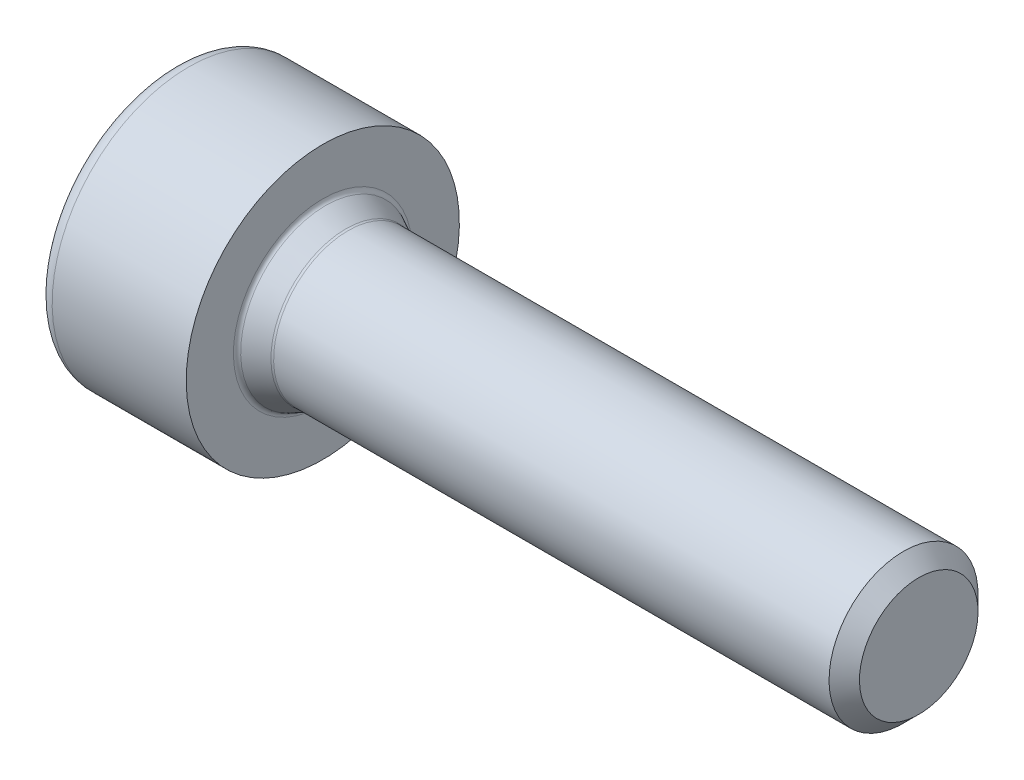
ISO-10303-21;
HEADER;
FILE_DESCRIPTION(('STEP AP214'),'2;1');
FILE_NAME('part.step','',(''),(''),'','','');
FILE_SCHEMA(('AUTOMOTIVE_DESIGN { 1 0 10303 214 1 1 1 1 }'));
ENDSEC;
DATA;
#1=APPLICATION_CONTEXT('core data for automotive mechanical design processes');
#2=APPLICATION_PROTOCOL_DEFINITION('international standard','automotive_design',2000,#1);
#3=PRODUCT_CONTEXT('',#1,'mechanical');
#4=PRODUCT('Part','Part','',(#3));
#5=PRODUCT_RELATED_PRODUCT_CATEGORY('part','',(#4));
#6=PRODUCT_DEFINITION_FORMATION('','',#4);
#7=PRODUCT_DEFINITION_CONTEXT('part definition',#1,'design');
#8=PRODUCT_DEFINITION('design','',#6,#7);
#9=PRODUCT_DEFINITION_SHAPE('','',#8);
#10=(LENGTH_UNIT() NAMED_UNIT(*) SI_UNIT(.MILLI.,.METRE.));
#11=(NAMED_UNIT(*) PLANE_ANGLE_UNIT() SI_UNIT($,.RADIAN.));
#12=(NAMED_UNIT(*) SI_UNIT($,.STERADIAN.) SOLID_ANGLE_UNIT());
#13=UNCERTAINTY_MEASURE_WITH_UNIT(LENGTH_MEASURE(1.E-05),#10,'distance_accuracy_value','');
#14=(GEOMETRIC_REPRESENTATION_CONTEXT(3) GLOBAL_UNCERTAINTY_ASSIGNED_CONTEXT((#13)) GLOBAL_UNIT_ASSIGNED_CONTEXT((#10,
#11,#12)) REPRESENTATION_CONTEXT('',''));
#15=CARTESIAN_POINT('',(0.,0.,0.));
#16=DIRECTION('',(0.,0.,1.));
#17=DIRECTION('',(1.,0.,0.));
#18=AXIS2_PLACEMENT_3D('',#15,#16,#17);
#19=CARTESIAN_POINT('',(-500.428312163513,0.,0.));
#20=DIRECTION('',(-1.,0.,0.));
#21=DIRECTION('',(0.,-1.,0.));
#22=AXIS2_PLACEMENT_3D('',#19,#20,#21);
#23=CONICAL_SURFACE('',#22,866.025403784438,1.0471975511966);
#24=CARTESIAN_POINT('',(-0.428312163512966,0.,0.));
#25=VERTEX_POINT('',#24);
#26=VERTEX_LOOP('',#25);
#27=FACE_BOUND('',#26,.T.);
#28=CARTESIAN_POINT('',(-1.15,0.,0.));
#29=DIRECTION('',(1.,0.,0.));
#30=DIRECTION('',(0.,1.,0.));
#31=AXIS2_PLACEMENT_3D('',#28,#29,#30);
#32=CIRCLE('',#31,1.25);
#33=CARTESIAN_POINT('',(-1.15,1.08253175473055,-0.625));
#34=VERTEX_POINT('',#33);
#35=CARTESIAN_POINT('',(-1.15,1.08253175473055,0.625));
#36=VERTEX_POINT('',#35);
#37=EDGE_CURVE('E125',#34,#36,#32,.T.);
#38=ORIENTED_EDGE('',*,*,#37,.F.);
#39=CARTESIAN_POINT('',(-1.15,0.,0.));
#40=DIRECTION('',(1.,0.,0.));
#41=DIRECTION('',(0.,1.,0.));
#42=AXIS2_PLACEMENT_3D('',#39,#40,#41);
#43=CIRCLE('',#42,1.25);
#44=CARTESIAN_POINT('',(-1.15,0.,-1.25));
#45=VERTEX_POINT('',#44);
#46=EDGE_CURVE('E120',#45,#34,#43,.T.);
#47=ORIENTED_EDGE('',*,*,#46,.F.);
#48=CARTESIAN_POINT('',(-1.15,0.,0.));
#49=DIRECTION('',(1.,0.,0.));
#50=DIRECTION('',(0.,1.,0.));
#51=AXIS2_PLACEMENT_3D('',#48,#49,#50);
#52=CIRCLE('',#51,1.25);
#53=CARTESIAN_POINT('',(-1.15,-1.08253175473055,-0.625));
#54=VERTEX_POINT('',#53);
#55=EDGE_CURVE('E122',#54,#45,#52,.T.);
#56=ORIENTED_EDGE('',*,*,#55,.F.);
#57=CARTESIAN_POINT('',(-1.15,0.,0.));
#58=DIRECTION('',(1.,0.,0.));
#59=DIRECTION('',(0.,1.,0.));
#60=AXIS2_PLACEMENT_3D('',#57,#58,#59);
#61=CIRCLE('',#60,1.25);
#62=CARTESIAN_POINT('',(-1.15,-1.08253175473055,0.625));
#63=VERTEX_POINT('',#62);
#64=EDGE_CURVE('E37',#63,#54,#61,.T.);
#65=ORIENTED_EDGE('',*,*,#64,.F.);
#66=CARTESIAN_POINT('',(-1.15,0.,0.));
#67=DIRECTION('',(1.,0.,0.));
#68=DIRECTION('',(0.,1.,0.));
#69=AXIS2_PLACEMENT_3D('',#66,#67,#68);
#70=CIRCLE('',#69,1.25);
#71=CARTESIAN_POINT('',(-1.15,0.,1.25));
#72=VERTEX_POINT('',#71);
#73=EDGE_CURVE('E10',#72,#63,#70,.T.);
#74=ORIENTED_EDGE('',*,*,#73,.F.);
#75=CARTESIAN_POINT('',(-1.15,0.,0.));
#76=DIRECTION('',(1.,0.,0.));
#77=DIRECTION('',(0.,1.,0.));
#78=AXIS2_PLACEMENT_3D('',#75,#76,#77);
#79=CIRCLE('',#78,1.25);
#80=EDGE_CURVE('E29',#36,#72,#79,.T.);
#81=ORIENTED_EDGE('',*,*,#80,.F.);
#82=EDGE_LOOP('',(#38,#47,#56,#65,#74,#81));
#83=FACE_BOUND('',#82,.T.);
#84=ADVANCED_FACE('F16',(#27,#83),#23,.F.);
#85=CARTESIAN_POINT('',(-3.75,-1.44337567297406,0.));
#86=DIRECTION('',(0.,-0.866025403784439,-0.5));
#87=DIRECTION('',(0.,0.5,-0.866025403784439));
#88=AXIS2_PLACEMENT_3D('',#85,#86,#87);
#89=PLANE('',#88);
#90=DIRECTION('',(0.,0.5,-0.866025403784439));
#91=VECTOR('',#90,1.);
#92=CARTESIAN_POINT('',(-1.15,-1.44337567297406,0.));
#93=LINE('',#92,#91);
#94=CARTESIAN_POINT('',(-1.15,-0.721687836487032,-1.25));
#95=VERTEX_POINT('',#94);
#96=EDGE_CURVE('E137',#54,#95,#93,.T.);
#97=ORIENTED_EDGE('',*,*,#96,.T.);
#98=DIRECTION('',(1.,0.,0.));
#99=VECTOR('',#98,1.);
#100=CARTESIAN_POINT('',(-3.75,-0.721687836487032,-1.25));
#101=LINE('',#100,#99);
#102=CARTESIAN_POINT('',(-2.99423353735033,-0.721687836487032,-1.25));
#103=VERTEX_POINT('',#102);
#104=EDGE_CURVE('E146',#103,#95,#101,.T.);
#105=ORIENTED_EDGE('',*,*,#104,.F.);
#106=CARTESIAN_POINT('',(-2.99423353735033,-1.44337567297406,0.));
#107=CARTESIAN_POINT('',(-2.97957371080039,-1.42871173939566,-0.0253962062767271));
#108=CARTESIAN_POINT('',(-2.96543639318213,-1.41390821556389,-0.0510256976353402));
#109=CARTESIAN_POINT('',(-2.93891149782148,-1.38455135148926,-0.101852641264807));
#110=CARTESIAN_POINT('',(-2.92647940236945,-1.37000802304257,-0.127032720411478));
#111=CARTESIAN_POINT('',(-2.9033584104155,-1.34111080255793,-0.177081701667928));
#112=CARTESIAN_POINT('',(-2.89262714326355,-1.32676522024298,-0.201935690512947));
#113=CARTESIAN_POINT('',(-2.87291009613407,-1.29818727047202,-0.25146253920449));
#114=CARTESIAN_POINT('',(-2.86388702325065,-1.28396122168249,-0.276124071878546));
#115=CARTESIAN_POINT('',(-2.85116247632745,-1.26178056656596,-0.314526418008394));
#116=CARTESIAN_POINT('',(-2.84690628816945,-1.25391439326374,-0.328136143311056));
#117=CARTESIAN_POINT('',(-2.83896351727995,-1.23824608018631,-0.355229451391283));
#118=CARTESIAN_POINT('',(-2.83526845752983,-1.23044513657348,-0.368711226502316));
#119=CARTESIAN_POINT('',(-2.82844925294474,-1.21489851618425,-0.395584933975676));
#120=CARTESIAN_POINT('',(-2.82531779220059,-1.20715361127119,-0.408975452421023));
#121=CARTESIAN_POINT('',(-2.81962387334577,-1.19170446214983,-0.435700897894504));
#122=CARTESIAN_POINT('',(-2.81705562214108,-1.18400068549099,-0.449034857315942));
#123=CARTESIAN_POINT('',(-2.81248669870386,-1.16861644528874,-0.47568127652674));
#124=CARTESIAN_POINT('',(-2.81048203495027,-1.16093621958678,-0.488993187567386));
#125=CARTESIAN_POINT('',(-2.80703820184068,-1.14557791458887,-0.51562856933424));
#126=CARTESIAN_POINT('',(-2.80559707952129,-1.13789992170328,-0.528951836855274));
#127=CARTESIAN_POINT('',(-2.80327877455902,-1.12252202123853,-0.55564234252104));
#128=CARTESIAN_POINT('',(-2.80240183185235,-1.1148221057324,-0.569009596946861));
#129=CARTESIAN_POINT('',(-2.80120761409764,-1.09937057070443,-0.595817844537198));
#130=CARTESIAN_POINT('',(-2.80089282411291,-1.09161887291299,-0.609258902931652));
#131=CARTESIAN_POINT('',(-2.80082875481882,-1.07615046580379,-0.636054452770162));
#132=CARTESIAN_POINT('',(-2.80107607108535,-1.06843382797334,-0.649408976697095));
#133=CARTESIAN_POINT('',(-2.80214246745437,-1.05303545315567,-0.676066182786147));
#134=CARTESIAN_POINT('',(-2.80295996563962,-1.04535367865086,-0.689368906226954));
#135=CARTESIAN_POINT('',(-2.8051623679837,-1.03000750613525,-0.715960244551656));
#136=CARTESIAN_POINT('',(-2.8065480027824,-1.02234314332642,-0.729248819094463));
#137=CARTESIAN_POINT('',(-2.80988487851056,-1.00701331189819,-0.755848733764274));
#138=CARTESIAN_POINT('',(-2.81183907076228,-0.999348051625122,-0.76915982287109));
#139=CARTESIAN_POINT('',(-2.81631079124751,-0.983994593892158,-0.795839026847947));
#140=CARTESIAN_POINT('',(-2.81883330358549,-0.976306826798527,-0.809206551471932));
#141=CARTESIAN_POINT('',(-2.82443948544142,-0.960883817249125,-0.836030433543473));
#142=CARTESIAN_POINT('',(-2.82752990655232,-0.953149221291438,-0.849485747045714));
#143=CARTESIAN_POINT('',(-2.83427116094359,-0.937606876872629,-0.876514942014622));
#144=CARTESIAN_POINT('',(-2.8379302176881,-0.929799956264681,-0.890087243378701));
#145=CARTESIAN_POINT('',(-2.84580378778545,-0.914080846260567,-0.91737563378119));
#146=CARTESIAN_POINT('',(-2.85002758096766,-0.906169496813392,-0.931089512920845));
#147=CARTESIAN_POINT('',(-2.86275065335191,-0.883668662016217,-0.970039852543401));
#148=CARTESIAN_POINT('',(-2.87182341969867,-0.86913963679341,-0.995125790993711));
#149=CARTESIAN_POINT('',(-2.89167439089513,-0.839994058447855,-1.04544920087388));
#150=CARTESIAN_POINT('',(-2.90248795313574,-0.825383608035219,-1.07067614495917));
#151=CARTESIAN_POINT('',(-2.92580460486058,-0.796003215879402,-1.12142938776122));
#152=CARTESIAN_POINT('',(-2.93834898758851,-0.781241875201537,-1.14694156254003));
#153=CARTESIAN_POINT('',(-2.96512860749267,-0.751491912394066,-1.19839367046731));
#154=CARTESIAN_POINT('',(-2.97940799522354,-0.736513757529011,-1.22431675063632));
#155=CARTESIAN_POINT('',(-2.9942335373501,-0.721687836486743,-1.2499999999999));
#156=B_SPLINE_CURVE_WITH_KNOTS('',3,(#106,#107,#108,#109,#110,#111,#112,#113,#114,#115,#116,
#117,#118,#119,#120,#121,#122,#123,#124,#125,#126,#127,#128,#129,#130,#131,#132,#133,#134,#135,
#136,#137,#138,#139,#140,#141,#142,#143,#144,#145,#146,#147,#148,#149,#150,#151,#152,#153,#154,
#155),.UNSPECIFIED.,.F.,.F.,(4,2,2,2,2,2,2,2,2,2,2,2,2,2,2,2,2,2,2,2,2,2,2,2,4),(0.,
0.0983661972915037,0.193211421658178,0.285089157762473,0.374642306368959,0.423491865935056,
0.471508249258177,0.518847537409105,0.565674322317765,0.612160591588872,0.658484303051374,
0.70482770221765,0.751375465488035,0.797642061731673,0.843780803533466,0.889979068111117,
0.936421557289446,0.98328839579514,1.03075343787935,1.07898286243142,1.12813410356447,
1.21921525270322,1.31245749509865,1.40852753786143,1.50800018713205),.UNSPECIFIED.);
#157=CARTESIAN_POINT('',(-2.99423353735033,-1.44337567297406,0.));
#158=VERTEX_POINT('',#157);
#159=EDGE_CURVE('E193',#158,#103,#156,.T.);
#160=ORIENTED_EDGE('',*,*,#159,.F.);
#161=DIRECTION('',(1.,0.,0.));
#162=VECTOR('',#161,1.);
#163=CARTESIAN_POINT('',(-3.75,-1.44337567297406,0.));
#164=LINE('',#163,#162);
#165=CARTESIAN_POINT('',(-1.15,-1.44337567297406,0.));
#166=VERTEX_POINT('',#165);
#167=EDGE_CURVE('E185',#158,#166,#164,.T.);
#168=ORIENTED_EDGE('',*,*,#167,.T.);
#169=DIRECTION('',(0.,0.5,-0.866025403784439));
#170=VECTOR('',#169,1.);
#171=CARTESIAN_POINT('',(-1.15,-1.44337567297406,0.));
#172=LINE('',#171,#170);
#173=EDGE_CURVE('E138',#166,#54,#172,.T.);
#174=ORIENTED_EDGE('',*,*,#173,.T.);
#175=EDGE_LOOP('',(#97,#105,#160,#168,#174));
#176=FACE_BOUND('',#175,.T.);
#177=ADVANCED_FACE('F359',(#176),#89,.F.);
#178=CARTESIAN_POINT('',(-1.15,0.,0.));
#179=DIRECTION('',(1.,0.,0.));
#180=DIRECTION('',(0.,0.,-1.));
#181=AXIS2_PLACEMENT_3D('',#178,#179,#180);
#182=PLANE('',#181);
#183=DIRECTION('',(0.,-0.5,-0.866025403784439));
#184=VECTOR('',#183,1.);
#185=CARTESIAN_POINT('',(-1.15,-0.721687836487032,1.25));
#186=LINE('',#185,#184);
#187=CARTESIAN_POINT('',(-1.15,-0.721687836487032,1.25));
#188=VERTEX_POINT('',#187);
#189=EDGE_CURVE('E176',#188,#63,#186,.T.);
#190=ORIENTED_EDGE('',*,*,#189,.F.);
#191=DIRECTION('',(0.,-1.,0.));
#192=VECTOR('',#191,1.);
#193=CARTESIAN_POINT('',(-1.15,0.721687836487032,1.25));
#194=LINE('',#193,#192);
#195=EDGE_CURVE('E174',#72,#188,#194,.T.);
#196=ORIENTED_EDGE('',*,*,#195,.F.);
#197=ORIENTED_EDGE('',*,*,#73,.T.);
#198=EDGE_LOOP('',(#190,#196,#197));
#199=FACE_BOUND('',#198,.T.);
#200=ADVANCED_FACE('F364',(#199),#182,.F.);
#201=CARTESIAN_POINT('',(-1.15,0.,0.));
#202=DIRECTION('',(1.,0.,0.));
#203=DIRECTION('',(0.,0.,-1.));
#204=AXIS2_PLACEMENT_3D('',#201,#202,#203);
#205=PLANE('',#204);
#206=DIRECTION('',(0.,-1.,0.));
#207=VECTOR('',#206,1.);
#208=CARTESIAN_POINT('',(-1.15,0.721687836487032,1.25));
#209=LINE('',#208,#207);
#210=CARTESIAN_POINT('',(-1.15,0.721687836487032,1.25));
#211=VERTEX_POINT('',#210);
#212=EDGE_CURVE('E163',#211,#72,#209,.T.);
#213=ORIENTED_EDGE('',*,*,#212,.F.);
#214=DIRECTION('',(0.,-0.5,0.866025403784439));
#215=VECTOR('',#214,1.);
#216=CARTESIAN_POINT('',(-1.15,1.44337567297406,0.));
#217=LINE('',#216,#215);
#218=EDGE_CURVE('E203',#36,#211,#217,.T.);
#219=ORIENTED_EDGE('',*,*,#218,.F.);
#220=ORIENTED_EDGE('',*,*,#80,.T.);
#221=EDGE_LOOP('',(#213,#219,#220));
#222=FACE_BOUND('',#221,.T.);
#223=ADVANCED_FACE('F369',(#222),#205,.F.);
#224=CARTESIAN_POINT('',(-1.15,0.,0.));
#225=DIRECTION('',(1.,0.,0.));
#226=DIRECTION('',(0.,0.,-1.));
#227=AXIS2_PLACEMENT_3D('',#224,#225,#226);
#228=PLANE('',#227);
#229=DIRECTION('',(0.,-0.5,0.866025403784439));
#230=VECTOR('',#229,1.);
#231=CARTESIAN_POINT('',(-1.15,1.44337567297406,0.));
#232=LINE('',#231,#230);
#233=CARTESIAN_POINT('',(-1.15,1.44337567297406,0.));
#234=VERTEX_POINT('',#233);
#235=EDGE_CURVE('E167',#234,#36,#232,.T.);
#236=ORIENTED_EDGE('',*,*,#235,.F.);
#237=DIRECTION('',(0.,0.5,0.866025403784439));
#238=VECTOR('',#237,1.);
#239=CARTESIAN_POINT('',(-1.15,0.721687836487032,-1.25));
#240=LINE('',#239,#238);
#241=EDGE_CURVE('E164',#34,#234,#240,.T.);
#242=ORIENTED_EDGE('',*,*,#241,.F.);
#243=ORIENTED_EDGE('',*,*,#37,.T.);
#244=EDGE_LOOP('',(#236,#242,#243));
#245=FACE_BOUND('',#244,.T.);
#246=ADVANCED_FACE('F303',(#245),#228,.F.);
#247=CARTESIAN_POINT('',(-1.15,0.,0.));
#248=DIRECTION('',(1.,0.,0.));
#249=DIRECTION('',(0.,0.,-1.));
#250=AXIS2_PLACEMENT_3D('',#247,#248,#249);
#251=PLANE('',#250);
#252=DIRECTION('',(0.,0.5,0.866025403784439));
#253=VECTOR('',#252,1.);
#254=CARTESIAN_POINT('',(-1.15,0.721687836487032,-1.25));
#255=LINE('',#254,#253);
#256=CARTESIAN_POINT('',(-1.15,0.721687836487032,-1.25));
#257=VERTEX_POINT('',#256);
#258=EDGE_CURVE('E150',#257,#34,#255,.T.);
#259=ORIENTED_EDGE('',*,*,#258,.F.);
#260=DIRECTION('',(0.,1.,0.));
#261=VECTOR('',#260,1.);
#262=CARTESIAN_POINT('',(-1.15,-0.721687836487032,-1.25));
#263=LINE('',#262,#261);
#264=EDGE_CURVE('E143',#45,#257,#263,.T.);
#265=ORIENTED_EDGE('',*,*,#264,.F.);
#266=ORIENTED_EDGE('',*,*,#46,.T.);
#267=EDGE_LOOP('',(#259,#265,#266));
#268=FACE_BOUND('',#267,.T.);
#269=ADVANCED_FACE('F149',(#268),#251,.F.);
#270=CARTESIAN_POINT('',(-1.15,0.,0.));
#271=DIRECTION('',(1.,0.,0.));
#272=DIRECTION('',(0.,0.,-1.));
#273=AXIS2_PLACEMENT_3D('',#270,#271,#272);
#274=PLANE('',#273);
#275=ORIENTED_EDGE('',*,*,#173,.F.);
#276=DIRECTION('',(0.,-0.5,-0.866025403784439));
#277=VECTOR('',#276,1.);
#278=CARTESIAN_POINT('',(-1.15,-0.721687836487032,1.25));
#279=LINE('',#278,#277);
#280=EDGE_CURVE('E147',#63,#166,#279,.T.);
#281=ORIENTED_EDGE('',*,*,#280,.F.);
#282=ORIENTED_EDGE('',*,*,#64,.T.);
#283=EDGE_LOOP('',(#275,#281,#282));
#284=FACE_BOUND('',#283,.T.);
#285=ADVANCED_FACE('F229',(#284),#274,.F.);
#286=CARTESIAN_POINT('',(-1.15,0.,0.));
#287=DIRECTION('',(1.,0.,0.));
#288=DIRECTION('',(0.,0.,-1.));
#289=AXIS2_PLACEMENT_3D('',#286,#287,#288);
#290=PLANE('',#289);
#291=DIRECTION('',(0.,1.,0.));
#292=VECTOR('',#291,1.);
#293=CARTESIAN_POINT('',(-1.15,-0.721687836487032,-1.25));
#294=LINE('',#293,#292);
#295=EDGE_CURVE('E135',#95,#45,#294,.T.);
#296=ORIENTED_EDGE('',*,*,#295,.F.);
#297=ORIENTED_EDGE('',*,*,#96,.F.);
#298=ORIENTED_EDGE('',*,*,#55,.T.);
#299=EDGE_LOOP('',(#296,#297,#298));
#300=FACE_BOUND('',#299,.T.);
#301=ADVANCED_FACE('F134',(#300),#290,.F.);
#302=CARTESIAN_POINT('',(-2.80085786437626,0.,0.));
#303=DIRECTION('',(-1.,0.,0.));
#304=DIRECTION('',(0.,-1.,0.));
#305=AXIS2_PLACEMENT_3D('',#302,#303,#304);
#306=CONICAL_SURFACE('',#305,1.25,0.785398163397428);
#307=CARTESIAN_POINT('',(-2.99423353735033,1.44337567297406,0.));
#308=CARTESIAN_POINT('',(-2.9795737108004,1.42871173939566,0.0253962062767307));
#309=CARTESIAN_POINT('',(-2.96543639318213,1.41390821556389,0.0510256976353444));
#310=CARTESIAN_POINT('',(-2.93891149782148,1.38455135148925,0.101852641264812));
#311=CARTESIAN_POINT('',(-2.92647940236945,1.37000802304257,0.127032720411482));
#312=CARTESIAN_POINT('',(-2.9033584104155,1.34111080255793,0.177081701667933));
#313=CARTESIAN_POINT('',(-2.89262714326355,1.32676522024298,0.201935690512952));
#314=CARTESIAN_POINT('',(-2.87291009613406,1.29818727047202,0.251462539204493));
#315=CARTESIAN_POINT('',(-2.86388702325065,1.28396122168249,0.276124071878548));
#316=CARTESIAN_POINT('',(-2.85116247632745,1.26178056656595,0.314526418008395));
#317=CARTESIAN_POINT('',(-2.84690628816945,1.25391439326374,0.328136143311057));
#318=CARTESIAN_POINT('',(-2.83896351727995,1.23824608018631,0.355229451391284));
#319=CARTESIAN_POINT('',(-2.83526845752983,1.23044513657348,0.368711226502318));
#320=CARTESIAN_POINT('',(-2.82844925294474,1.21489851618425,0.395584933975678));
#321=CARTESIAN_POINT('',(-2.82531779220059,1.20715361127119,0.408975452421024));
#322=CARTESIAN_POINT('',(-2.81962387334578,1.19170446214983,0.435700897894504));
#323=CARTESIAN_POINT('',(-2.81705562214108,1.18400068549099,0.449034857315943));
#324=CARTESIAN_POINT('',(-2.81248669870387,1.16861644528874,0.475681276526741));
#325=CARTESIAN_POINT('',(-2.81048203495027,1.16093621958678,0.488993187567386));
#326=CARTESIAN_POINT('',(-2.80703820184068,1.14557791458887,0.51562856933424));
#327=CARTESIAN_POINT('',(-2.80559707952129,1.13789992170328,0.528951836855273));
#328=CARTESIAN_POINT('',(-2.80327877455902,1.12252202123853,0.555642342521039));
#329=CARTESIAN_POINT('',(-2.80240183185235,1.1148221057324,0.56900959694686));
#330=CARTESIAN_POINT('',(-2.80120761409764,1.09937057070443,0.595817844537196));
#331=CARTESIAN_POINT('',(-2.80089282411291,1.091618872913,0.609258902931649));
#332=CARTESIAN_POINT('',(-2.80082875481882,1.07615046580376,0.63605445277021));
#333=CARTESIAN_POINT('',(-2.80107607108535,1.06843382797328,0.649408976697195));
#334=CARTESIAN_POINT('',(-2.80214246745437,1.05303545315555,0.676066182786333));
#335=CARTESIAN_POINT('',(-2.80295996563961,1.04535367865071,0.689368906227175));
#336=CARTESIAN_POINT('',(-2.8051623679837,1.03000750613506,0.71596024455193));
#337=CARTESIAN_POINT('',(-2.8065480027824,1.02234314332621,0.729248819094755));
#338=CARTESIAN_POINT('',(-2.80988487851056,1.00701331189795,0.75584873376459));
#339=CARTESIAN_POINT('',(-2.81183907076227,0.999348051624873,0.769159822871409));
#340=CARTESIAN_POINT('',(-2.81631079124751,0.983994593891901,0.795839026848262));
#341=CARTESIAN_POINT('',(-2.81883330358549,0.97630682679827,0.809206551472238));
#342=CARTESIAN_POINT('',(-2.82443948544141,0.960883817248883,0.836030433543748));
#343=CARTESIAN_POINT('',(-2.82752990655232,0.95314922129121,0.849485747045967));
#344=CARTESIAN_POINT('',(-2.83427116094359,0.93760687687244,0.87651494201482));
#345=CARTESIAN_POINT('',(-2.83793021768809,0.929799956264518,0.890087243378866));
#346=CARTESIAN_POINT('',(-2.84580378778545,0.914080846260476,0.917375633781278));
#347=CARTESIAN_POINT('',(-2.85002758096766,0.906169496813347,0.93108951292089));
#348=CARTESIAN_POINT('',(-2.86275065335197,0.883668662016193,0.970039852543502));
#349=CARTESIAN_POINT('',(-2.87182341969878,0.869139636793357,0.995125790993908));
#350=CARTESIAN_POINT('',(-2.89167439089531,0.83999405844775,1.04544920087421));
#351=CARTESIAN_POINT('',(-2.90248795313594,0.825383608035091,1.07067614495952));
#352=CARTESIAN_POINT('',(-2.92580460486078,0.796003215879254,1.12142938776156));
#353=CARTESIAN_POINT('',(-2.93834898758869,0.781241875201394,1.14694156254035));
#354=CARTESIAN_POINT('',(-2.96512860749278,0.751491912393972,1.19839367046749));
#355=CARTESIAN_POINT('',(-2.97940799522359,0.736513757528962,1.22431675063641));
#356=CARTESIAN_POINT('',(-2.9942335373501,0.721687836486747,1.2499999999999));
#357=B_SPLINE_CURVE_WITH_KNOTS('',3,(#307,#308,#309,#310,#311,#312,#313,#314,#315,#316,#317,
#318,#319,#320,#321,#322,#323,#324,#325,#326,#327,#328,#329,#330,#331,#332,#333,#334,#335,#336,
#337,#338,#339,#340,#341,#342,#343,#344,#345,#346,#347,#348,#349,#350,#351,#352,#353,#354,#355,
#356),.UNSPECIFIED.,.F.,.F.,(4,2,2,2,2,2,2,2,2,2,2,2,2,2,2,2,2,2,2,2,2,2,2,2,4),(0.,
0.0983661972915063,0.193211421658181,0.285089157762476,0.374642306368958,0.423491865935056,
0.471508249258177,0.518847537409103,0.565674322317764,0.612160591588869,0.658484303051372,
0.704827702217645,0.75137546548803,0.797642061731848,0.843780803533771,0.889979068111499,
0.936421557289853,0.983288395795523,1.03075343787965,1.07898286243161,1.12813410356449,
1.21921525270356,1.31245749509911,1.40852753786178,1.50800018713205),.UNSPECIFIED.);
#358=CARTESIAN_POINT('',(-2.99423353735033,1.44337567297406,0.));
#359=VERTEX_POINT('',#358);
#360=CARTESIAN_POINT('',(-2.99423353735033,0.721687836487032,1.25));
#361=VERTEX_POINT('',#360);
#362=EDGE_CURVE('E391',#359,#361,#357,.T.);
#363=ORIENTED_EDGE('',*,*,#362,.T.);
#364=CARTESIAN_POINT('',(-2.99423353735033,0.721687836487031,1.25));
#365=CARTESIAN_POINT('',(-2.97946716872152,0.692148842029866,1.24999873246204));
#366=CARTESIAN_POINT('',(-2.96523064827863,0.662334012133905,1.24999298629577));
#367=CARTESIAN_POINT('',(-2.93853433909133,0.603211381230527,1.2499821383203));
#368=CARTESIAN_POINT('',(-2.92602898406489,0.573924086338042,1.24997702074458));
#369=CARTESIAN_POINT('',(-2.90278827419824,0.515718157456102,1.24997564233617));
#370=CARTESIAN_POINT('',(-2.89200958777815,0.486816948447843,1.24997910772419));
#371=CARTESIAN_POINT('',(-2.87222450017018,0.42922870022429,1.24999386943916));
#372=CARTESIAN_POINT('',(-2.86318006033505,0.400554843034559,1.25000496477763));
#373=CARTESIAN_POINT('',(-2.85047786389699,0.356010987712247,1.24999731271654));
#374=CARTESIAN_POINT('',(-2.84625232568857,0.340301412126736,1.24998992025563));
#375=CARTESIAN_POINT('',(-2.83837055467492,0.309023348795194,1.24996743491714));
#376=CARTESIAN_POINT('',(-2.83470586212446,0.293457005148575,1.24995247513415));
#377=CARTESIAN_POINT('',(-2.82794710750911,0.262429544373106,1.24992547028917));
#378=CARTESIAN_POINT('',(-2.82484575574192,0.246970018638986,1.24991338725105));
#379=CARTESIAN_POINT('',(-2.81921175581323,0.216119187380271,1.24989663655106));
#380=CARTESIAN_POINT('',(-2.81667334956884,0.200728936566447,1.24989189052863));
#381=CARTESIAN_POINT('',(-2.81216380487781,0.169978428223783,1.24989185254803));
#382=CARTESIAN_POINT('',(-2.81018871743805,0.154618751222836,1.24989649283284));
#383=CARTESIAN_POINT('',(-2.80680373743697,0.123890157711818,1.24991345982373));
#384=CARTESIAN_POINT('',(-2.80539193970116,0.108521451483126,1.24992576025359));
#385=CARTESIAN_POINT('',(-2.8031319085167,0.0777346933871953,1.2499533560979));
#386=CARTESIAN_POINT('',(-2.80228396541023,0.0623166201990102,1.24996865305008));
#387=CARTESIAN_POINT('',(-2.80114763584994,0.0313904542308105,1.24999160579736));
#388=CARTESIAN_POINT('',(-2.80086178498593,0.0158822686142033,1.2499992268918));
#389=CARTESIAN_POINT('',(-2.80085406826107,-0.0150837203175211,1.25000077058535));
#390=CARTESIAN_POINT('',(-2.80113036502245,-0.0305415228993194,1.24999473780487));
#391=CARTESIAN_POINT('',(-2.80225550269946,-0.0613915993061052,1.24998561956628));
#392=CARTESIAN_POINT('',(-2.80310268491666,-0.0767839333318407,1.24998252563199));
#393=CARTESIAN_POINT('',(-2.80536549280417,-0.107544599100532,1.24998364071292));
#394=CARTESIAN_POINT('',(-2.80678177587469,-0.122912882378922,1.24998785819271));
#395=CARTESIAN_POINT('',(-2.81018091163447,-0.153666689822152,1.25000634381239));
#396=CARTESIAN_POINT('',(-2.81216664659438,-0.169051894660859,1.2500206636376));
#397=CARTESIAN_POINT('',(-2.81670242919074,-0.199880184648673,1.2500579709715));
#398=CARTESIAN_POINT('',(-2.81925739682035,-0.215322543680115,1.25008103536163));
#399=CARTESIAN_POINT('',(-2.82492945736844,-0.24630499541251,1.25013085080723));
#400=CARTESIAN_POINT('',(-2.82805324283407,-0.261843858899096,1.25015764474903));
#401=CARTESIAN_POINT('',(-2.8348621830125,-0.293057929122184,1.2502079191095));
#402=CARTESIAN_POINT('',(-2.83855550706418,-0.308731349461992,1.25023133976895));
#403=CARTESIAN_POINT('',(-2.84649859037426,-0.340252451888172,1.25026005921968));
#404=CARTESIAN_POINT('',(-2.85075758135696,-0.356097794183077,1.25026500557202));
#405=CARTESIAN_POINT('',(-2.86350330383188,-0.400839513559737,1.25025444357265));
#406=CARTESIAN_POINT('',(-2.87254909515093,-0.429578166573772,1.25021839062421));
#407=CARTESIAN_POINT('',(-2.89232129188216,-0.487241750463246,1.25014846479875));
#408=CARTESIAN_POINT('',(-2.90308291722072,-0.51615450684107,1.25011466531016));
#409=CARTESIAN_POINT('',(-2.92627140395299,-0.574326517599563,1.25005815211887));
#410=CARTESIAN_POINT('',(-2.9387390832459,-0.603569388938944,1.25003580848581));
#411=CARTESIAN_POINT('',(-2.96534127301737,-0.662543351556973,1.25000552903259));
#412=CARTESIAN_POINT('',(-2.97951925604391,-0.692254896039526,1.24999813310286));
#413=CARTESIAN_POINT('',(-2.99423353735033,-0.721687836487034,1.25));
#414=B_SPLINE_CURVE_WITH_KNOTS('',3,(#364,#365,#366,#367,#368,#369,#370,#371,#372,#373,#374,
#375,#376,#377,#378,#379,#380,#381,#382,#383,#384,#385,#386,#387,#388,#389,#390,#391,#392,#393,
#394,#395,#396,#397,#398,#399,#400,#401,#402,#403,#404,#405,#406,#407,#408,#409,#410,#411,#412,
#413),.UNSPECIFIED.,.F.,.F.,(4,2,2,2,2,2,2,2,2,2,2,2,2,2,2,2,2,2,2,2,2,2,2,2,4),(0.,
0.0990817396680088,0.194589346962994,0.287089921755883,0.377242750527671,0.426039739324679,
0.474006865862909,0.521300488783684,0.568085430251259,0.614533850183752,0.660823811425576,
0.707137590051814,0.753659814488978,0.800030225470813,0.846266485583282,0.892556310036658,
0.939084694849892,0.986032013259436,1.03357232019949,1.08187194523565,1.13108842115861,
1.22142841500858,1.31394349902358,1.40928388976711,1.5080103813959),.UNSPECIFIED.);
#415=CARTESIAN_POINT('',(-2.99423353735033,-0.721687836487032,1.25));
#416=VERTEX_POINT('',#415);
#417=EDGE_CURVE('E175',#361,#416,#414,.T.);
#418=ORIENTED_EDGE('',*,*,#417,.T.);
#419=CARTESIAN_POINT('',(-2.99423353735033,-0.721687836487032,1.25));
#420=CARTESIAN_POINT('',(-2.97957371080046,-0.736349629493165,1.22460255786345));
#421=CARTESIAN_POINT('',(-2.96543639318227,-0.751143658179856,1.19896758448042));
#422=CARTESIAN_POINT('',(-2.93891149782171,-0.780482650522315,1.14813032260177));
#423=CARTESIAN_POINT('',(-2.9264794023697,-0.795017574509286,1.12294539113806));
#424=CARTESIAN_POINT('',(-2.90335841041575,-0.823912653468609,1.07289517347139));
#425=CARTESIAN_POINT('',(-2.89262714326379,-0.838264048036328,1.04804454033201));
#426=CARTESIAN_POINT('',(-2.87291009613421,-0.866866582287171,0.998531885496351));
#427=CARTESIAN_POINT('',(-2.86388702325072,-0.881111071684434,0.973880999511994));
#428=CARTESIAN_POINT('',(-2.8511624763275,-0.903278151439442,0.935470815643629));
#429=CARTESIAN_POINT('',(-2.84690628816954,-0.911131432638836,0.921853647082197));
#430=CARTESIAN_POINT('',(-2.83896351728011,-0.926760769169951,0.894737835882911));
#431=CARTESIAN_POINT('',(-2.83526845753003,-0.934535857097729,0.881241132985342));
#432=CARTESIAN_POINT('',(-2.82844925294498,-0.95003586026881,0.854340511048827));
#433=CARTESIAN_POINT('',(-2.82531779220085,-0.95775993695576,0.840937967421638));
#434=CARTESIAN_POINT('',(-2.81962387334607,-0.973180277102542,0.814195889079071));
#435=CARTESIAN_POINT('',(-2.81705562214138,-0.98087593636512,0.800857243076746));
#436=CARTESIAN_POINT('',(-2.81248669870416,-0.996260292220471,0.774210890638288));
#437=CARTESIAN_POINT('',(-2.81048203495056,-1.00394863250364,0.760903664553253));
#438=CARTESIAN_POINT('',(-2.80703820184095,-1.01933639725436,0.734285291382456));
#439=CARTESIAN_POINT('',(-2.80559707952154,-1.02703568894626,0.720974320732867));
#440=CARTESIAN_POINT('',(-2.80327877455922,-1.04246139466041,0.694311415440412));
#441=CARTESIAN_POINT('',(-2.80240183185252,-1.05018781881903,0.680959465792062));
#442=CARTESIAN_POINT('',(-2.80120761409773,-1.06567867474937,0.65417392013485));
#443=CARTESIAN_POINT('',(-2.80089282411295,-1.07344312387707,0.640740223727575));
#444=CARTESIAN_POINT('',(-2.80082875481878,-1.0889145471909,0.613946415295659));
#445=CARTESIAN_POINT('',(-2.80107607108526,-1.09662158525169,0.600586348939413));
#446=CARTESIAN_POINT('',(-2.8021424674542,-1.11200821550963,0.573922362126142));
#447=CARTESIAN_POINT('',(-2.80295996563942,-1.11968782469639,0.560618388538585));
#448=CARTESIAN_POINT('',(-2.80516236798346,-1.13504351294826,0.534032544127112));
#449=CARTESIAN_POINT('',(-2.80654800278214,-1.14271957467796,0.52075072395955));
#450=CARTESIAN_POINT('',(-2.80988487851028,-1.15809086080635,0.494174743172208));
#451=CARTESIAN_POINT('',(-2.81183907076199,-1.16578597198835,0.480880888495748));
#452=CARTESIAN_POINT('',(-2.81631079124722,-1.18121411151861,0.45424480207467));
#453=CARTESIAN_POINT('',(-2.81883330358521,-1.18894684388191,0.440903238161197));
#454=CARTESIAN_POINT('',(-2.82443948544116,-1.20446550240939,0.414134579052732));
#455=CARTESIAN_POINT('',(-2.82752990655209,-1.21225084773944,0.400708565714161));
#456=CARTESIAN_POINT('',(-2.8342711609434,-1.22788764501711,0.373733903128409));
#457=CARTESIAN_POINT('',(-2.83793021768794,-1.23573814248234,0.360186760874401));
#458=CARTESIAN_POINT('',(-2.84580378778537,-1.25151102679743,0.332929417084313));
#459=CARTESIAN_POINT('',(-2.85002758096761,-1.25943191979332,0.319221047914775));
#460=CARTESIAN_POINT('',(-2.8627506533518,-1.28191348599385,0.280259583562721));
#461=CARTESIAN_POINT('',(-2.87182341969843,-1.29637403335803,0.255134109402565));
#462=CARTESIAN_POINT('',(-2.89167439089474,-1.32538259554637,0.204731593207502));
#463=CARTESIAN_POINT('',(-2.90248795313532,-1.33992454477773,0.179465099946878));
#464=CARTESIAN_POINT('',(-2.92580460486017,-1.36918794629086,0.128644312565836));
#465=CARTESIAN_POINT('',(-2.93834898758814,-1.38390146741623,0.103104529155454));
#466=CARTESIAN_POINT('',(-2.96512860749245,-1.41358531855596,0.0516142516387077));
#467=CARTESIAN_POINT('',(-2.97940799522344,-1.42854628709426,0.0256812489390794));
#468=CARTESIAN_POINT('',(-2.9942335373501,-1.44337567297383,0.));
#469=B_SPLINE_CURVE_WITH_KNOTS('',3,(#419,#420,#421,#422,#423,#424,#425,#426,#427,#428,#429,
#430,#431,#432,#433,#434,#435,#436,#437,#438,#439,#440,#441,#442,#443,#444,#445,#446,#447,#448,
#449,#450,#451,#452,#453,#454,#455,#456,#457,#458,#459,#460,#461,#462,#463,#464,#465,#466,#467,
#468),.UNSPECIFIED.,.F.,.F.,(4,2,2,2,2,2,2,2,2,2,2,2,2,2,2,2,2,2,2,2,2,2,2,2,4),(0.,
0.0983661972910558,0.193211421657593,0.285089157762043,0.374642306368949,0.423491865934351,
0.471508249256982,0.518847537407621,0.565674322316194,0.612160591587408,0.658484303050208,
0.704827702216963,0.751375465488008,0.797642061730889,0.843780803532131,0.889979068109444,
0.936421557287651,0.983288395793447,1.03075343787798,1.07898286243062,1.12813410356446,
1.21921525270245,1.31245749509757,1.40852753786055,1.50800018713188),.UNSPECIFIED.);
#470=EDGE_CURVE('E383',#416,#158,#469,.T.);
#471=ORIENTED_EDGE('',*,*,#470,.T.);
#472=ORIENTED_EDGE('',*,*,#159,.T.);
#473=CARTESIAN_POINT('',(-2.99423353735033,-0.721687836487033,-1.25));
#474=CARTESIAN_POINT('',(-2.97952284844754,-0.692262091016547,-1.2499981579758));
#475=CARTESIAN_POINT('',(-2.9653486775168,-0.662557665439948,-1.2500061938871));
#476=CARTESIAN_POINT('',(-2.93875141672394,-0.603593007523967,-1.25003805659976));
#477=CARTESIAN_POINT('',(-2.92628506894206,-0.574352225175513,-1.25006133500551));
#478=CARTESIAN_POINT('',(-2.90309671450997,-0.516179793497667,-1.25011919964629));
#479=CARTESIAN_POINT('',(-2.89233412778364,-0.487264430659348,-1.25015343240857));
#480=CARTESIAN_POINT('',(-2.87255678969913,-0.429591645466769,-1.25022203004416));
#481=CARTESIAN_POINT('',(-2.86350708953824,-0.400846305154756,-1.25025637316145));
#482=CARTESIAN_POINT('',(-2.85075901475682,-0.356106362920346,-1.25026395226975));
#483=CARTESIAN_POINT('',(-2.84650112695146,-0.340269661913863,-1.25025790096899));
#484=CARTESIAN_POINT('',(-2.83856009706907,-0.308763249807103,-1.2502281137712));
#485=CARTESIAN_POINT('',(-2.83486778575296,-0.293095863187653,-1.2502047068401));
#486=CARTESIAN_POINT('',(-2.82806035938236,-0.261891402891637,-1.2501549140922));
#487=CARTESIAN_POINT('',(-2.82493715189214,-0.246356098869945,-1.25012858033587));
#488=CARTESIAN_POINT('',(-2.81926581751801,-0.215378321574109,-1.25007995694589));
#489=CARTESIAN_POINT('',(-2.81671107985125,-0.199937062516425,-1.25005762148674));
#490=CARTESIAN_POINT('',(-2.8121753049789,-0.169108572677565,-1.25002174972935));
#491=CARTESIAN_POINT('',(-2.81018943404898,-0.153722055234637,-1.2500081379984));
#492=CARTESIAN_POINT('',(-2.806789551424,-0.122963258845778,-1.24999076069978));
#493=CARTESIAN_POINT('',(-2.80537274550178,-0.107591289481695,-1.24998694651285));
#494=CARTESIAN_POINT('',(-2.80310850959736,-0.0768209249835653,-1.24998616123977));
#495=CARTESIAN_POINT('',(-2.80226050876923,-0.0614225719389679,-1.2499891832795));
#496=CARTESIAN_POINT('',(-2.8011330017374,-0.0305581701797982,-1.24999707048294));
#497=CARTESIAN_POINT('',(-2.80085523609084,-0.0150920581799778,-1.25000194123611));
#498=CARTESIAN_POINT('',(-2.80086061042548,0.0158738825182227,-1.24999805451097));
#499=CARTESIAN_POINT('',(-2.80114498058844,0.0313737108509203,-1.24998926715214));
#500=CARTESIAN_POINT('',(-2.8022789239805,0.0622854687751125,-1.24996508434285));
#501=CARTESIAN_POINT('',(-2.80312604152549,0.0776974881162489,-1.24994971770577));
#502=CARTESIAN_POINT('',(-2.8053846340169,0.108474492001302,-1.24992245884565));
#503=CARTESIAN_POINT('',(-2.80679590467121,0.123839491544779,-1.2499105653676));
#504=CARTESIAN_POINT('',(-2.81018013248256,0.154563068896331,-1.24989471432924));
#505=CARTESIAN_POINT('',(-2.81215508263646,0.169921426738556,-1.24989078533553));
#506=CARTESIAN_POINT('',(-2.81666463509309,0.200671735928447,-1.24989226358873));
#507=CARTESIAN_POINT('',(-2.81920327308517,0.216063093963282,-1.24989774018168));
#508=CARTESIAN_POINT('',(-2.82483800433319,0.246918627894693,-1.24991568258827));
#509=CARTESIAN_POINT('',(-2.82793993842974,0.262381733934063,-1.24992822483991));
#510=CARTESIAN_POINT('',(-2.834700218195,0.293418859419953,-1.24995570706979));
#511=CARTESIAN_POINT('',(-2.83836593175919,0.308991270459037,-1.24997067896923));
#512=CARTESIAN_POINT('',(-2.84624977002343,0.340284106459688,-1.24999208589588));
#513=CARTESIAN_POINT('',(-2.8504764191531,0.356002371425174,-1.24999836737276));
#514=CARTESIAN_POINT('',(-2.86317623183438,0.400547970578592,-1.25000301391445));
#515=CARTESIAN_POINT('',(-2.87221671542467,0.429215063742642,-1.24999018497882));
#516=CARTESIAN_POINT('',(-2.89199659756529,0.486794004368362,-1.24997407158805));
#517=CARTESIAN_POINT('',(-2.90277431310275,0.515692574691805,-1.24997104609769));
#518=CARTESIAN_POINT('',(-2.92601515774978,0.573898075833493,-1.24997379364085));
#519=CARTESIAN_POINT('',(-2.93852185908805,0.603187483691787,-1.24997985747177));
#520=CARTESIAN_POINT('',(-2.96522315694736,0.662319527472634,-1.24999231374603));
#521=CARTESIAN_POINT('',(-2.97946353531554,0.692141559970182,-1.24999870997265));
#522=CARTESIAN_POINT('',(-2.99423353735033,0.721687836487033,-1.25));
#523=B_SPLINE_CURVE_WITH_KNOTS('',3,(#473,#474,#475,#476,#477,#478,#479,#480,#481,#482,#483,
#484,#485,#486,#487,#488,#489,#490,#491,#492,#493,#494,#495,#496,#497,#498,#499,#500,#501,#502,
#503,#504,#505,#506,#507,#508,#509,#510,#511,#512,#513,#514,#515,#516,#517,#518,#519,#520,#521,
#522),.UNSPECIFIED.,.F.,.F.,(4,2,2,2,2,2,2,2,2,2,2,2,2,2,2,2,2,2,2,2,2,2,2,2,4),(0.,
0.0987023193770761,0.194035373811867,0.286558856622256,0.376921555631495,0.426112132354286,
0.474393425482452,0.521922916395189,0.568866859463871,0.615399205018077,0.661700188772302,
0.707954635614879,0.754350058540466,0.800847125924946,0.847142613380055,0.893421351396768,
0.939865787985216,0.986654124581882,1.03395862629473,1.08194418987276,1.13076722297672,
1.22089707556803,1.31338915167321,1.40890418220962,1.50801038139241),.UNSPECIFIED.);
#524=CARTESIAN_POINT('',(-2.99423353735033,0.721687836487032,-1.25));
#525=VERTEX_POINT('',#524);
#526=EDGE_CURVE('E152',#103,#525,#523,.T.);
#527=ORIENTED_EDGE('',*,*,#526,.T.);
#528=CARTESIAN_POINT('',(-2.99423353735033,0.721687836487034,-1.25));
#529=CARTESIAN_POINT('',(-2.97957371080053,0.736349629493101,-1.22460255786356));
#530=CARTESIAN_POINT('',(-2.9654363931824,0.751143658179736,-1.19896758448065));
#531=CARTESIAN_POINT('',(-2.93891149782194,0.780482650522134,-1.14813032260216));
#532=CARTESIAN_POINT('',(-2.92647940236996,0.7950175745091,-1.1229453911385));
#533=CARTESIAN_POINT('',(-2.90335841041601,0.823912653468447,-1.07289517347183));
#534=CARTESIAN_POINT('',(-2.89262714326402,0.838264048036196,-1.04804454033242));
#535=CARTESIAN_POINT('',(-2.87291009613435,0.866866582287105,-0.998531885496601));
#536=CARTESIAN_POINT('',(-2.86388702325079,0.881111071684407,-0.973880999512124));
#537=CARTESIAN_POINT('',(-2.85116247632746,0.903278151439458,-0.935470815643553));
#538=CARTESIAN_POINT('',(-2.84690628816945,0.911131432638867,-0.921853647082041));
#539=CARTESIAN_POINT('',(-2.83896351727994,0.926760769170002,-0.894737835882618));
#540=CARTESIAN_POINT('',(-2.83526845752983,0.934535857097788,-0.881241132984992));
#541=CARTESIAN_POINT('',(-2.82844925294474,0.950035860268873,-0.854340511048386));
#542=CARTESIAN_POINT('',(-2.82531779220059,0.957759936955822,-0.840937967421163));
#543=CARTESIAN_POINT('',(-2.81962387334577,0.973180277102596,-0.81419588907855));
#544=CARTESIAN_POINT('',(-2.81705562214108,0.980875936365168,-0.800857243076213));
#545=CARTESIAN_POINT('',(-2.81248669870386,0.996260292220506,-0.774210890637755));
#546=CARTESIAN_POINT('',(-2.81048203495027,1.00394863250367,-0.760903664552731));
#547=CARTESIAN_POINT('',(-2.80703820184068,1.01933639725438,-0.734285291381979));
#548=CARTESIAN_POINT('',(-2.80559707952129,1.02703568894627,-0.720974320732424));
#549=CARTESIAN_POINT('',(-2.80327877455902,1.04246139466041,-0.694311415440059));
#550=CARTESIAN_POINT('',(-2.80240183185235,1.05018781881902,-0.680959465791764));
#551=CARTESIAN_POINT('',(-2.80120761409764,1.06567867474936,-0.65417392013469));
#552=CARTESIAN_POINT('',(-2.80089282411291,1.07344312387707,-0.640740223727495));
#553=CARTESIAN_POINT('',(-2.80082875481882,1.0889145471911,-0.61394641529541));
#554=CARTESIAN_POINT('',(-2.80107607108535,1.09662158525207,-0.600586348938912));
#555=CARTESIAN_POINT('',(-2.80214246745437,1.11200821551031,-0.573922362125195));
#556=CARTESIAN_POINT('',(-2.80295996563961,1.11968782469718,-0.560618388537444));
#557=CARTESIAN_POINT('',(-2.8051623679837,1.13504351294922,-0.534032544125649));
#558=CARTESIAN_POINT('',(-2.8065480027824,1.14271957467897,-0.52075072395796));
#559=CARTESIAN_POINT('',(-2.80988487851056,1.15809086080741,-0.494174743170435));
#560=CARTESIAN_POINT('',(-2.81183907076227,1.16578597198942,-0.480880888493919));
#561=CARTESIAN_POINT('',(-2.81631079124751,1.18121411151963,-0.454244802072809));
#562=CARTESIAN_POINT('',(-2.81883330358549,1.18894684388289,-0.440903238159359));
#563=CARTESIAN_POINT('',(-2.82443948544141,1.20446550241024,-0.414134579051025));
#564=CARTESIAN_POINT('',(-2.82752990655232,1.21225084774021,-0.400708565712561));
#565=CARTESIAN_POINT('',(-2.83427116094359,1.2278876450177,-0.373733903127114));
#566=CARTESIAN_POINT('',(-2.83793021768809,1.23573814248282,-0.360186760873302));
#567=CARTESIAN_POINT('',(-2.84580378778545,1.25151102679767,-0.332929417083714));
#568=CARTESIAN_POINT('',(-2.85002758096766,1.25943191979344,-0.319221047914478));
#569=CARTESIAN_POINT('',(-2.86275065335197,1.28191348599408,-0.28025958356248));
#570=CARTESIAN_POINT('',(-2.87182341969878,1.29637403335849,-0.255134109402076));
#571=CARTESIAN_POINT('',(-2.89167439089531,1.32538259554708,-0.20473159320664));
#572=CARTESIAN_POINT('',(-2.90248795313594,1.33992454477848,-0.179465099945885));
#573=CARTESIAN_POINT('',(-2.92580460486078,1.36918794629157,-0.128644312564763));
#574=CARTESIAN_POINT('',(-2.93834898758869,1.38390146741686,-0.103104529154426));
#575=CARTESIAN_POINT('',(-2.96512860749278,1.41358531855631,-0.0516142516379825));
#576=CARTESIAN_POINT('',(-2.97940799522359,1.42854628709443,-0.0256812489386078));
#577=CARTESIAN_POINT('',(-2.9942335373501,1.44337567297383,1.99523894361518E-13));
#578=B_SPLINE_CURVE_WITH_KNOTS('',3,(#528,#529,#530,#531,#532,#533,#534,#535,#536,#537,#538,
#539,#540,#541,#542,#543,#544,#545,#546,#547,#548,#549,#550,#551,#552,#553,#554,#555,#556,#557,
#558,#559,#560,#561,#562,#563,#564,#565,#566,#567,#568,#569,#570,#571,#572,#573,#574,#575,#576,
#577),.UNSPECIFIED.,.F.,.F.,(4,2,2,2,2,2,2,2,2,2,2,2,2,2,2,2,2,2,2,2,2,2,2,2,4),(0.,
0.0983661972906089,0.193211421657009,0.285089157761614,0.374642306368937,0.423491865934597,
0.471508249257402,0.518847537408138,0.565674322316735,0.612160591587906,0.658484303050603,
0.7048277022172,0.751375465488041,0.797642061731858,0.843780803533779,0.889979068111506,
0.93642155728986,0.983288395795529,1.03075343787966,1.07898286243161,1.12813410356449,
1.21921525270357,1.31245749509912,1.40852753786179,1.50800018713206),.UNSPECIFIED.);
#579=EDGE_CURVE('E166',#525,#359,#578,.T.);
#580=ORIENTED_EDGE('',*,*,#579,.T.);
#581=EDGE_LOOP('',(#363,#418,#471,#472,#527,#580));
#582=FACE_BOUND('',#581,.T.);
#583=CARTESIAN_POINT('',(-3.,0.,0.));
#584=DIRECTION('',(1.,0.,0.));
#585=DIRECTION('',(0.,1.,0.));
#586=AXIS2_PLACEMENT_3D('',#583,#584,#585);
#587=CIRCLE('',#586,1.44914213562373);
#588=CARTESIAN_POINT('',(-3.,1.44914213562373,0.));
#589=VERTEX_POINT('',#588);
#590=EDGE_CURVE('E180',#589,#589,#587,.T.);
#591=ORIENTED_EDGE('',*,*,#590,.F.);
#592=EDGE_LOOP('',(#591));
#593=FACE_BOUND('',#592,.T.);
#594=ADVANCED_FACE('F216',(#582,#593),#306,.F.);
#595=CARTESIAN_POINT('',(-3.,1.44914213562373,0.));
#596=DIRECTION('',(1.,0.,0.));
#597=DIRECTION('',(0.,1.,0.));
#598=AXIS2_PLACEMENT_3D('',#595,#596,#597);
#599=PLANE('',#598);
#600=ORIENTED_EDGE('',*,*,#590,.T.);
#601=EDGE_LOOP('',(#600));
#602=FACE_BOUND('',#601,.T.);
#603=CARTESIAN_POINT('',(-3.,0.,0.));
#604=DIRECTION('',(1.,0.,0.));
#605=DIRECTION('',(0.,1.,0.));
#606=AXIS2_PLACEMENT_3D('',#603,#604,#605);
#607=CIRCLE('',#606,2.45);
#608=CARTESIAN_POINT('',(-3.,2.45,0.));
#609=VERTEX_POINT('',#608);
#610=EDGE_CURVE('E178',#609,#609,#607,.T.);
#611=ORIENTED_EDGE('',*,*,#610,.F.);
#612=EDGE_LOOP('',(#611));
#613=FACE_BOUND('',#612,.T.);
#614=ADVANCED_FACE('F226',(#602,#613),#599,.F.);
#615=CARTESIAN_POINT('',(-2.7,0.,0.));
#616=DIRECTION('',(1.,0.,0.));
#617=DIRECTION('',(0.,1.,0.));
#618=AXIS2_PLACEMENT_3D('',#615,#616,#617);
#619=TOROIDAL_SURFACE('',#618,2.45,0.3);
#620=CARTESIAN_POINT('',(-2.7,0.,0.));
#621=DIRECTION('',(1.,0.,0.));
#622=DIRECTION('',(0.,1.,0.));
#623=AXIS2_PLACEMENT_3D('',#620,#621,#622);
#624=CIRCLE('',#623,2.75);
#625=CARTESIAN_POINT('',(-2.7,2.75,0.));
#626=VERTEX_POINT('',#625);
#627=EDGE_CURVE('E181',#626,#626,#624,.T.);
#628=ORIENTED_EDGE('',*,*,#627,.F.);
#629=EDGE_LOOP('',(#628));
#630=FACE_BOUND('',#629,.T.);
#631=ORIENTED_EDGE('',*,*,#610,.T.);
#632=EDGE_LOOP('',(#631));
#633=FACE_BOUND('',#632,.T.);
#634=ADVANCED_FACE('F227',(#630,#633),#619,.T.);
#635=CARTESIAN_POINT('',(15.,0.,0.));
#636=DIRECTION('',(1.,0.,0.));
#637=DIRECTION('',(0.,1.,0.));
#638=AXIS2_PLACEMENT_3D('',#635,#636,#637);
#639=CYLINDRICAL_SURFACE('',#638,2.75);
#640=ORIENTED_EDGE('',*,*,#627,.T.);
#641=EDGE_LOOP('',(#640));
#642=FACE_BOUND('',#641,.T.);
#643=CARTESIAN_POINT('',(0.,0.,0.));
#644=DIRECTION('',(1.,0.,0.));
#645=DIRECTION('',(0.,1.,0.));
#646=AXIS2_PLACEMENT_3D('',#643,#644,#645);
#647=CIRCLE('',#646,2.75);
#648=CARTESIAN_POINT('',(0.,2.75,0.));
#649=VERTEX_POINT('',#648);
#650=EDGE_CURVE('E183',#649,#649,#647,.T.);
#651=ORIENTED_EDGE('',*,*,#650,.F.);
#652=EDGE_LOOP('',(#651));
#653=FACE_BOUND('',#652,.T.);
#654=ADVANCED_FACE('F345',(#642,#653),#639,.T.);
#655=CARTESIAN_POINT('',(0.,2.75,0.));
#656=DIRECTION('',(-1.,0.,0.));
#657=DIRECTION('',(0.,-1.,0.));
#658=AXIS2_PLACEMENT_3D('',#655,#656,#657);
#659=PLANE('',#658);
#660=ORIENTED_EDGE('',*,*,#650,.T.);
#661=EDGE_LOOP('',(#660));
#662=FACE_BOUND('',#661,.T.);
#663=CARTESIAN_POINT('',(0.,0.,0.));
#664=DIRECTION('',(1.,0.,0.));
#665=DIRECTION('',(0.,1.,0.));
#666=AXIS2_PLACEMENT_3D('',#663,#664,#665);
#667=CIRCLE('',#666,1.8);
#668=CARTESIAN_POINT('',(0.,1.8,0.));
#669=VERTEX_POINT('',#668);
#670=EDGE_CURVE('E195',#669,#669,#667,.T.);
#671=ORIENTED_EDGE('',*,*,#670,.F.);
#672=EDGE_LOOP('',(#671));
#673=FACE_BOUND('',#672,.T.);
#674=ADVANCED_FACE('F341',(#662,#673),#659,.F.);
#675=CARTESIAN_POINT('',(0.1,0.,0.));
#676=DIRECTION('',(1.,0.,0.));
#677=DIRECTION('',(0.,1.,0.));
#678=AXIS2_PLACEMENT_3D('',#675,#676,#677);
#679=TOROIDAL_SURFACE('',#678,1.8,0.1);
#680=ORIENTED_EDGE('',*,*,#670,.T.);
#681=EDGE_LOOP('',(#680));
#682=FACE_BOUND('',#681,.T.);
#683=CARTESIAN_POINT('',(0.0561576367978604,0.,0.));
#684=DIRECTION('',(1.,0.,0.));
#685=DIRECTION('',(0.,1.,0.));
#686=AXIS2_PLACEMENT_3D('',#683,#684,#685);
#687=CIRCLE('',#686,1.71012315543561);
#688=CARTESIAN_POINT('',(0.0561576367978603,1.71012315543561,0.));
#689=VERTEX_POINT('',#688);
#690=EDGE_CURVE('E170',#689,#689,#687,.T.);
#691=ORIENTED_EDGE('',*,*,#690,.F.);
#692=EDGE_LOOP('',(#691));
#693=FACE_BOUND('',#692,.T.);
#694=ADVANCED_FACE('F297',(#682,#693),#679,.F.);
#695=CARTESIAN_POINT('',(0.0561576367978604,0.,0.));
#696=DIRECTION('',(-1.,0.,0.));
#697=DIRECTION('',(0.,-1.,0.));
#698=AXIS2_PLACEMENT_3D('',#695,#696,#697);
#699=CONICAL_SURFACE('',#698,1.71012315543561,0.453844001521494);
#700=ORIENTED_EDGE('',*,*,#690,.T.);
#701=EDGE_LOOP('',(#700));
#702=FACE_BOUND('',#701,.T.);
#703=CARTESIAN_POINT('',(0.466157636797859,0.,0.));
#704=DIRECTION('',(1.,0.,0.));
#705=DIRECTION('',(0.,1.,0.));
#706=AXIS2_PLACEMENT_3D('',#703,#704,#705);
#707=CIRCLE('',#706,1.51012315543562);
#708=CARTESIAN_POINT('',(0.466157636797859,1.51012315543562,0.));
#709=VERTEX_POINT('',#708);
#710=EDGE_CURVE('E168',#709,#709,#707,.T.);
#711=ORIENTED_EDGE('',*,*,#710,.F.);
#712=EDGE_LOOP('',(#711));
#713=FACE_BOUND('',#712,.T.);
#714=ADVANCED_FACE('F293',(#702,#713),#699,.T.);
#715=CARTESIAN_POINT('',(0.51000000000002,0.,0.));
#716=DIRECTION('',(1.,0.,0.));
#717=DIRECTION('',(0.,1.,0.));
#718=AXIS2_PLACEMENT_3D('',#715,#716,#717);
#719=TOROIDAL_SURFACE('',#718,1.6,0.100000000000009);
#720=ORIENTED_EDGE('',*,*,#710,.T.);
#721=EDGE_LOOP('',(#720));
#722=FACE_BOUND('',#721,.T.);
#723=CARTESIAN_POINT('',(0.510000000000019,0.,0.));
#724=DIRECTION('',(1.,0.,0.));
#725=DIRECTION('',(0.,1.,0.));
#726=AXIS2_PLACEMENT_3D('',#723,#724,#725);
#727=CIRCLE('',#726,1.5);
#728=CARTESIAN_POINT('',(0.510000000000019,1.5,0.));
#729=VERTEX_POINT('',#728);
#730=EDGE_CURVE('E171',#729,#729,#727,.T.);
#731=ORIENTED_EDGE('',*,*,#730,.F.);
#732=EDGE_LOOP('',(#731));
#733=FACE_BOUND('',#732,.T.);
#734=ADVANCED_FACE('F290',(#722,#733),#719,.F.);
#735=CARTESIAN_POINT('',(15.,0.,0.));
#736=DIRECTION('',(1.,0.,0.));
#737=DIRECTION('',(0.,1.,0.));
#738=AXIS2_PLACEMENT_3D('',#735,#736,#737);
#739=CYLINDRICAL_SURFACE('',#738,1.5);
#740=ORIENTED_EDGE('',*,*,#730,.T.);
#741=EDGE_LOOP('',(#740));
#742=FACE_BOUND('',#741,.T.);
#743=CARTESIAN_POINT('',(11.6935,0.,0.));
#744=DIRECTION('',(1.,0.,0.));
#745=DIRECTION('',(0.,1.,0.));
#746=AXIS2_PLACEMENT_3D('',#743,#744,#745);
#747=CIRCLE('',#746,1.5);
#748=CARTESIAN_POINT('',(11.6935,1.5,0.));
#749=VERTEX_POINT('',#748);
#750=EDGE_CURVE('E162',#749,#749,#747,.T.);
#751=ORIENTED_EDGE('',*,*,#750,.F.);
#752=EDGE_LOOP('',(#751));
#753=FACE_BOUND('',#752,.T.);
#754=ADVANCED_FACE('F288',(#742,#753),#739,.T.);
#755=CARTESIAN_POINT('',(11.6935,0.,0.));
#756=DIRECTION('',(-1.,0.,0.));
#757=DIRECTION('',(0.,-1.,0.));
#758=AXIS2_PLACEMENT_3D('',#755,#756,#757);
#759=CONICAL_SURFACE('',#758,1.5,0.785398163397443);
#760=ORIENTED_EDGE('',*,*,#750,.T.);
#761=EDGE_LOOP('',(#760));
#762=FACE_BOUND('',#761,.T.);
#763=CARTESIAN_POINT('',(12.,0.,0.));
#764=DIRECTION('',(1.,0.,0.));
#765=DIRECTION('',(0.,1.,0.));
#766=AXIS2_PLACEMENT_3D('',#763,#764,#765);
#767=CIRCLE('',#766,1.1935);
#768=CARTESIAN_POINT('',(12.,1.1935,0.));
#769=VERTEX_POINT('',#768);
#770=EDGE_CURVE('E160',#769,#769,#767,.T.);
#771=ORIENTED_EDGE('',*,*,#770,.F.);
#772=EDGE_LOOP('',(#771));
#773=FACE_BOUND('',#772,.T.);
#774=ADVANCED_FACE('F284',(#762,#773),#759,.T.);
#775=CARTESIAN_POINT('',(12.,1.1935,0.));
#776=DIRECTION('',(-1.,0.,0.));
#777=DIRECTION('',(0.,-1.,0.));
#778=AXIS2_PLACEMENT_3D('',#775,#776,#777);
#779=PLANE('',#778);
#780=ORIENTED_EDGE('',*,*,#770,.T.);
#781=EDGE_LOOP('',(#780));
#782=FACE_BOUND('',#781,.T.);
#783=ADVANCED_FACE('F287',(#782),#779,.F.);
#784=CARTESIAN_POINT('',(-3.75,0.721687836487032,1.25));
#785=DIRECTION('',(0.,0.,1.));
#786=DIRECTION('',(1.,0.,0.));
#787=AXIS2_PLACEMENT_3D('',#784,#785,#786);
#788=PLANE('',#787);
#789=ORIENTED_EDGE('',*,*,#195,.T.);
#790=DIRECTION('',(1.,0.,0.));
#791=VECTOR('',#790,1.);
#792=CARTESIAN_POINT('',(-3.75,-0.721687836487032,1.25));
#793=LINE('',#792,#791);
#794=EDGE_CURVE('E199',#416,#188,#793,.T.);
#795=ORIENTED_EDGE('',*,*,#794,.F.);
#796=ORIENTED_EDGE('',*,*,#417,.F.);
#797=DIRECTION('',(1.,0.,0.));
#798=VECTOR('',#797,1.);
#799=CARTESIAN_POINT('',(-3.75,0.721687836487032,1.25));
#800=LINE('',#799,#798);
#801=EDGE_CURVE('E206',#361,#211,#800,.T.);
#802=ORIENTED_EDGE('',*,*,#801,.T.);
#803=ORIENTED_EDGE('',*,*,#212,.T.);
#804=EDGE_LOOP('',(#789,#795,#796,#802,#803));
#805=FACE_BOUND('',#804,.T.);
#806=ADVANCED_FACE('F18',(#805),#788,.F.);
#807=CARTESIAN_POINT('',(-3.75,-0.721687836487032,1.25));
#808=DIRECTION('',(0.,-0.866025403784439,0.5));
#809=DIRECTION('',(0.,-0.5,-0.866025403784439));
#810=AXIS2_PLACEMENT_3D('',#807,#808,#809);
#811=PLANE('',#810);
#812=ORIENTED_EDGE('',*,*,#280,.T.);
#813=ORIENTED_EDGE('',*,*,#167,.F.);
#814=ORIENTED_EDGE('',*,*,#470,.F.);
#815=ORIENTED_EDGE('',*,*,#794,.T.);
#816=ORIENTED_EDGE('',*,*,#189,.T.);
#817=EDGE_LOOP('',(#812,#813,#814,#815,#816));
#818=FACE_BOUND('',#817,.T.);
#819=ADVANCED_FACE('F304',(#818),#811,.F.);
#820=CARTESIAN_POINT('',(-3.75,-0.721687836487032,-1.25));
#821=DIRECTION('',(0.,0.,-1.));
#822=DIRECTION('',(-1.,0.,0.));
#823=AXIS2_PLACEMENT_3D('',#820,#821,#822);
#824=PLANE('',#823);
#825=ORIENTED_EDGE('',*,*,#264,.T.);
#826=DIRECTION('',(1.,0.,0.));
#827=VECTOR('',#826,1.);
#828=CARTESIAN_POINT('',(-3.75,0.721687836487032,-1.25));
#829=LINE('',#828,#827);
#830=EDGE_CURVE('E154',#525,#257,#829,.T.);
#831=ORIENTED_EDGE('',*,*,#830,.F.);
#832=ORIENTED_EDGE('',*,*,#526,.F.);
#833=ORIENTED_EDGE('',*,*,#104,.T.);
#834=ORIENTED_EDGE('',*,*,#295,.T.);
#835=EDGE_LOOP('',(#825,#831,#832,#833,#834));
#836=FACE_BOUND('',#835,.T.);
#837=ADVANCED_FACE('F141',(#836),#824,.F.);
#838=CARTESIAN_POINT('',(-3.75,0.721687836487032,-1.25));
#839=DIRECTION('',(0.,0.866025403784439,-0.5));
#840=DIRECTION('',(0.,0.5,0.866025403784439));
#841=AXIS2_PLACEMENT_3D('',#838,#839,#840);
#842=PLANE('',#841);
#843=ORIENTED_EDGE('',*,*,#241,.T.);
#844=DIRECTION('',(1.,0.,0.));
#845=VECTOR('',#844,1.);
#846=CARTESIAN_POINT('',(-3.75,1.44337567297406,0.));
#847=LINE('',#846,#845);
#848=EDGE_CURVE('E189',#359,#234,#847,.T.);
#849=ORIENTED_EDGE('',*,*,#848,.F.);
#850=ORIENTED_EDGE('',*,*,#579,.F.);
#851=ORIENTED_EDGE('',*,*,#830,.T.);
#852=ORIENTED_EDGE('',*,*,#258,.T.);
#853=EDGE_LOOP('',(#843,#849,#850,#851,#852));
#854=FACE_BOUND('',#853,.T.);
#855=ADVANCED_FACE('F271',(#854),#842,.F.);
#856=CARTESIAN_POINT('',(-3.75,1.44337567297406,0.));
#857=DIRECTION('',(0.,0.866025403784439,0.5));
#858=DIRECTION('',(0.,-0.5,0.866025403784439));
#859=AXIS2_PLACEMENT_3D('',#856,#857,#858);
#860=PLANE('',#859);
#861=ORIENTED_EDGE('',*,*,#218,.T.);
#862=ORIENTED_EDGE('',*,*,#801,.F.);
#863=ORIENTED_EDGE('',*,*,#362,.F.);
#864=ORIENTED_EDGE('',*,*,#848,.T.);
#865=ORIENTED_EDGE('',*,*,#235,.T.);
#866=EDGE_LOOP('',(#861,#862,#863,#864,#865));
#867=FACE_BOUND('',#866,.T.);
#868=ADVANCED_FACE('F280',(#867),#860,.F.);
#869=CLOSED_SHELL('',(#84,#177,#200,#223,#246,#269,#285,#301,#594,#614,#634,#654,#674,#694,#714,
#734,#754,#774,#783,#806,#819,#837,#855,#868));
#870=MANIFOLD_SOLID_BREP('B1',#869);
#871=ADVANCED_BREP_SHAPE_REPRESENTATION('',(#18,#870),#14);
#872=SHAPE_DEFINITION_REPRESENTATION(#9,#871);
ENDSEC;
END-ISO-10303-21;
